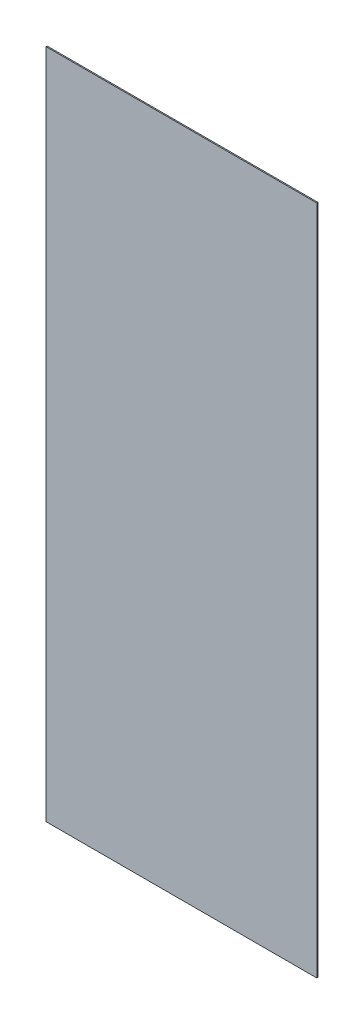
ISO-10303-21;
HEADER;
FILE_DESCRIPTION(('STEP AP214'),'2;1');
FILE_NAME('part.step','',(''),(''),'','','');
FILE_SCHEMA(('AUTOMOTIVE_DESIGN { 1 0 10303 214 1 1 1 1 }'));
ENDSEC;
DATA;
#1=APPLICATION_CONTEXT('core data for automotive mechanical design processes');
#2=APPLICATION_PROTOCOL_DEFINITION('international standard','automotive_design',2000,#1);
#3=PRODUCT_CONTEXT('',#1,'mechanical');
#4=PRODUCT('Part','Part','',(#3));
#5=PRODUCT_RELATED_PRODUCT_CATEGORY('part','',(#4));
#6=PRODUCT_DEFINITION_FORMATION('','',#4);
#7=PRODUCT_DEFINITION_CONTEXT('part definition',#1,'design');
#8=PRODUCT_DEFINITION('design','',#6,#7);
#9=PRODUCT_DEFINITION_SHAPE('','',#8);
#10=(LENGTH_UNIT() NAMED_UNIT(*) SI_UNIT(.MILLI.,.METRE.));
#11=(NAMED_UNIT(*) PLANE_ANGLE_UNIT() SI_UNIT($,.RADIAN.));
#12=(NAMED_UNIT(*) SI_UNIT($,.STERADIAN.) SOLID_ANGLE_UNIT());
#13=UNCERTAINTY_MEASURE_WITH_UNIT(LENGTH_MEASURE(1.E-05),#10,'distance_accuracy_value','');
#14=(GEOMETRIC_REPRESENTATION_CONTEXT(3) GLOBAL_UNCERTAINTY_ASSIGNED_CONTEXT((#13)) GLOBAL_UNIT_ASSIGNED_CONTEXT((#10,
#11,#12)) REPRESENTATION_CONTEXT('',''));
#15=CARTESIAN_POINT('',(0.,0.,0.));
#16=DIRECTION('',(0.,0.,1.));
#17=DIRECTION('',(1.,0.,0.));
#18=AXIS2_PLACEMENT_3D('',#15,#16,#17);
#19=CARTESIAN_POINT('',(2.53999999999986,1524.,2.54));
#20=DIRECTION('',(-1.,0.,0.));
#21=DIRECTION('',(0.,0.,1.));
#22=AXIS2_PLACEMENT_3D('',#19,#20,#21);
#23=PLANE('',#22);
#24=DIRECTION('',(0.,1.,0.));
#25=VECTOR('',#24,1.);
#26=CARTESIAN_POINT('',(2.53999999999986,1524.,0.));
#27=LINE('',#26,#25);
#28=CARTESIAN_POINT('',(2.53999999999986,0.,0.));
#29=VERTEX_POINT('',#28);
#30=CARTESIAN_POINT('',(2.53999999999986,1524.,0.));
#31=VERTEX_POINT('',#30);
#32=EDGE_CURVE('E106',#29,#31,#27,.T.);
#33=ORIENTED_EDGE('',*,*,#32,.T.);
#34=DIRECTION('',(0.,0.,-1.));
#35=VECTOR('',#34,1.);
#36=CARTESIAN_POINT('',(2.53999999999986,1524.,2.54));
#37=LINE('',#36,#35);
#38=CARTESIAN_POINT('',(2.53999999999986,1524.,2.54));
#39=VERTEX_POINT('',#38);
#40=EDGE_CURVE('E11',#39,#31,#37,.T.);
#41=ORIENTED_EDGE('',*,*,#40,.F.);
#42=DIRECTION('',(0.,1.,0.));
#43=VECTOR('',#42,1.);
#44=CARTESIAN_POINT('',(2.53999999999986,1524.,2.54));
#45=LINE('',#44,#43);
#46=CARTESIAN_POINT('',(2.53999999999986,0.,2.54));
#47=VERTEX_POINT('',#46);
#48=EDGE_CURVE('E94',#47,#39,#45,.T.);
#49=ORIENTED_EDGE('',*,*,#48,.F.);
#50=DIRECTION('',(0.,0.,-1.));
#51=VECTOR('',#50,1.);
#52=CARTESIAN_POINT('',(2.53999999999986,0.,2.54));
#53=LINE('',#52,#51);
#54=EDGE_CURVE('E105',#47,#29,#53,.T.);
#55=ORIENTED_EDGE('',*,*,#54,.T.);
#56=EDGE_LOOP('',(#33,#41,#49,#55));
#57=FACE_BOUND('',#56,.T.);
#58=ADVANCED_FACE('F43',(#57),#23,.F.);
#59=CARTESIAN_POINT('',(2.53999999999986,1524.,2.54));
#60=DIRECTION('',(0.,-1.,0.));
#61=DIRECTION('',(0.,0.,-1.));
#62=AXIS2_PLACEMENT_3D('',#59,#60,#61);
#63=PLANE('',#62);
#64=DIRECTION('',(-1.,0.,0.));
#65=VECTOR('',#64,1.);
#66=CARTESIAN_POINT('',(2.53999999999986,1524.,0.));
#67=LINE('',#66,#65);
#68=CARTESIAN_POINT('',(-612.14,1524.,0.));
#69=VERTEX_POINT('',#68);
#70=EDGE_CURVE('E98',#31,#69,#67,.T.);
#71=ORIENTED_EDGE('',*,*,#70,.T.);
#72=DIRECTION('',(0.,0.,-1.));
#73=VECTOR('',#72,1.);
#74=CARTESIAN_POINT('',(-612.14,1524.,2.54));
#75=LINE('',#74,#73);
#76=CARTESIAN_POINT('',(-612.14,1524.,2.54));
#77=VERTEX_POINT('',#76);
#78=EDGE_CURVE('E51',#77,#69,#75,.T.);
#79=ORIENTED_EDGE('',*,*,#78,.F.);
#80=DIRECTION('',(-1.,0.,0.));
#81=VECTOR('',#80,1.);
#82=CARTESIAN_POINT('',(2.53999999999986,1524.,2.54));
#83=LINE('',#82,#81);
#84=EDGE_CURVE('E90',#39,#77,#83,.T.);
#85=ORIENTED_EDGE('',*,*,#84,.F.);
#86=ORIENTED_EDGE('',*,*,#40,.T.);
#87=EDGE_LOOP('',(#71,#79,#85,#86));
#88=FACE_BOUND('',#87,.T.);
#89=ADVANCED_FACE('F100',(#88),#63,.F.);
#90=CARTESIAN_POINT('',(-612.14,1524.,2.54));
#91=DIRECTION('',(1.,0.,0.));
#92=DIRECTION('',(0.,0.,-1.));
#93=AXIS2_PLACEMENT_3D('',#90,#91,#92);
#94=PLANE('',#93);
#95=DIRECTION('',(0.,-1.,0.));
#96=VECTOR('',#95,1.);
#97=CARTESIAN_POINT('',(-612.14,1524.,0.));
#98=LINE('',#97,#96);
#99=CARTESIAN_POINT('',(-612.14,0.,0.));
#100=VERTEX_POINT('',#99);
#101=EDGE_CURVE('E76',#69,#100,#98,.T.);
#102=ORIENTED_EDGE('',*,*,#101,.T.);
#103=DIRECTION('',(0.,0.,-1.));
#104=VECTOR('',#103,1.);
#105=CARTESIAN_POINT('',(-612.14,0.,2.54));
#106=LINE('',#105,#104);
#107=CARTESIAN_POINT('',(-612.14,0.,2.54));
#108=VERTEX_POINT('',#107);
#109=EDGE_CURVE('E97',#108,#100,#106,.T.);
#110=ORIENTED_EDGE('',*,*,#109,.F.);
#111=DIRECTION('',(0.,-1.,0.));
#112=VECTOR('',#111,1.);
#113=CARTESIAN_POINT('',(-612.14,1524.,2.54));
#114=LINE('',#113,#112);
#115=EDGE_CURVE('E95',#77,#108,#114,.T.);
#116=ORIENTED_EDGE('',*,*,#115,.F.);
#117=ORIENTED_EDGE('',*,*,#78,.T.);
#118=EDGE_LOOP('',(#102,#110,#116,#117));
#119=FACE_BOUND('',#118,.T.);
#120=ADVANCED_FACE('F99',(#119),#94,.F.);
#121=CARTESIAN_POINT('',(2.53999999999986,0.,2.54));
#122=DIRECTION('',(0.,1.,0.));
#123=DIRECTION('',(0.,0.,1.));
#124=AXIS2_PLACEMENT_3D('',#121,#122,#123);
#125=PLANE('',#124);
#126=DIRECTION('',(1.,0.,0.));
#127=VECTOR('',#126,1.);
#128=CARTESIAN_POINT('',(2.53999999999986,0.,0.));
#129=LINE('',#128,#127);
#130=EDGE_CURVE('E84',#100,#29,#129,.T.);
#131=ORIENTED_EDGE('',*,*,#130,.T.);
#132=ORIENTED_EDGE('',*,*,#54,.F.);
#133=DIRECTION('',(1.,0.,0.));
#134=VECTOR('',#133,1.);
#135=CARTESIAN_POINT('',(2.53999999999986,0.,2.54));
#136=LINE('',#135,#134);
#137=EDGE_CURVE('E56',#108,#47,#136,.T.);
#138=ORIENTED_EDGE('',*,*,#137,.F.);
#139=ORIENTED_EDGE('',*,*,#109,.T.);
#140=EDGE_LOOP('',(#131,#132,#138,#139));
#141=FACE_BOUND('',#140,.T.);
#142=ADVANCED_FACE('F114',(#141),#125,.F.);
#143=CARTESIAN_POINT('',(2.53999999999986,0.,2.54));
#144=DIRECTION('',(0.,0.,-1.));
#145=DIRECTION('',(-1.,0.,0.));
#146=AXIS2_PLACEMENT_3D('',#143,#144,#145);
#147=PLANE('',#146);
#148=ORIENTED_EDGE('',*,*,#48,.T.);
#149=ORIENTED_EDGE('',*,*,#84,.T.);
#150=ORIENTED_EDGE('',*,*,#115,.T.);
#151=ORIENTED_EDGE('',*,*,#137,.T.);
#152=EDGE_LOOP('',(#148,#149,#150,#151));
#153=FACE_BOUND('',#152,.T.);
#154=ADVANCED_FACE('F89',(#153),#147,.F.);
#155=CARTESIAN_POINT('',(2.53999999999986,0.,0.));
#156=DIRECTION('',(0.,0.,-1.));
#157=DIRECTION('',(-1.,0.,0.));
#158=AXIS2_PLACEMENT_3D('',#155,#156,#157);
#159=PLANE('',#158);
#160=ORIENTED_EDGE('',*,*,#32,.F.);
#161=ORIENTED_EDGE('',*,*,#130,.F.);
#162=ORIENTED_EDGE('',*,*,#101,.F.);
#163=ORIENTED_EDGE('',*,*,#70,.F.);
#164=EDGE_LOOP('',(#160,#161,#162,#163));
#165=FACE_BOUND('',#164,.T.);
#166=ADVANCED_FACE('F116',(#165),#159,.T.);
#167=CLOSED_SHELL('',(#58,#89,#120,#142,#154,#166));
#168=MANIFOLD_SOLID_BREP('B2',#167);
#169=ADVANCED_BREP_SHAPE_REPRESENTATION('',(#18,#168),#14);
#170=SHAPE_DEFINITION_REPRESENTATION(#9,#169);
ENDSEC;
END-ISO-10303-21;
